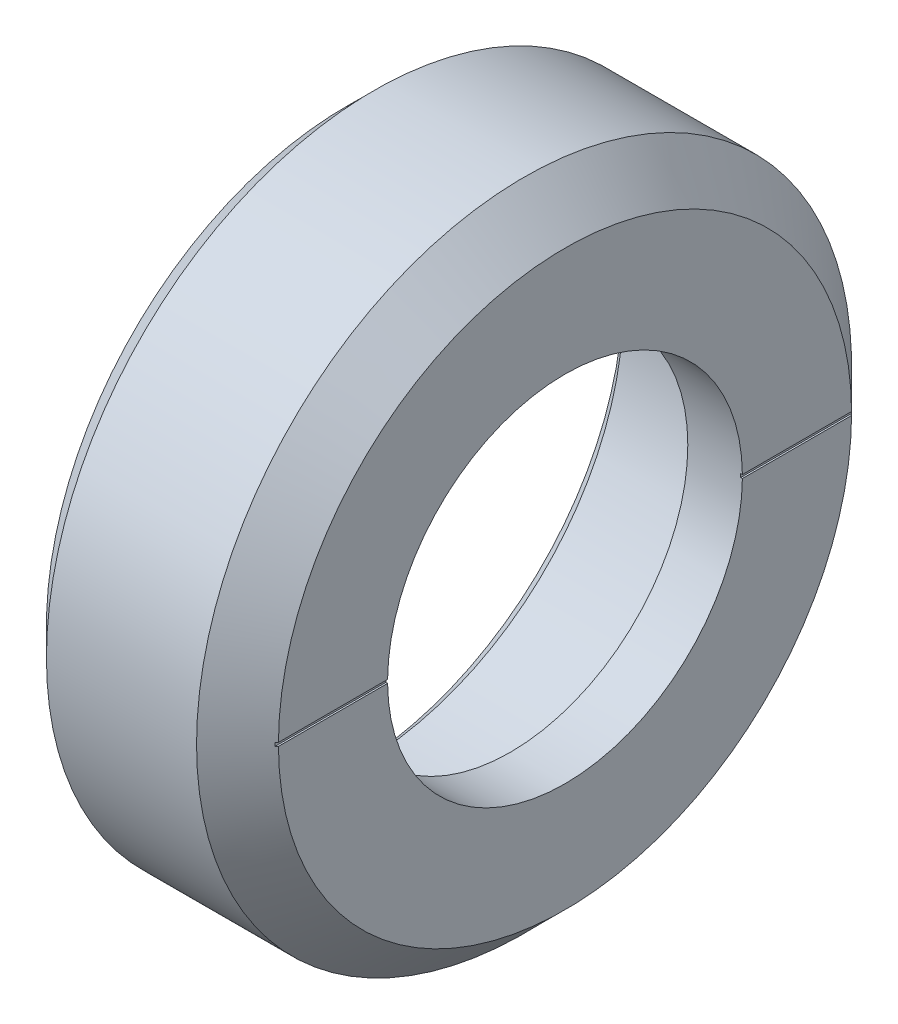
ISO-10303-21;
HEADER;
FILE_DESCRIPTION(('STEP AP214'),'2;1');
FILE_NAME('part.step','',(''),(''),'','','');
FILE_SCHEMA(('AUTOMOTIVE_DESIGN { 1 0 10303 214 1 1 1 1 }'));
ENDSEC;
DATA;
#1=APPLICATION_CONTEXT('core data for automotive mechanical design processes');
#2=APPLICATION_PROTOCOL_DEFINITION('international standard','automotive_design',2000,#1);
#3=PRODUCT_CONTEXT('',#1,'mechanical');
#4=PRODUCT('Part','Part','',(#3));
#5=PRODUCT_RELATED_PRODUCT_CATEGORY('part','',(#4));
#6=PRODUCT_DEFINITION_FORMATION('','',#4);
#7=PRODUCT_DEFINITION_CONTEXT('part definition',#1,'design');
#8=PRODUCT_DEFINITION('design','',#6,#7);
#9=PRODUCT_DEFINITION_SHAPE('','',#8);
#10=(LENGTH_UNIT() NAMED_UNIT(*) SI_UNIT(.MILLI.,.METRE.));
#11=(NAMED_UNIT(*) PLANE_ANGLE_UNIT() SI_UNIT($,.RADIAN.));
#12=(NAMED_UNIT(*) SI_UNIT($,.STERADIAN.) SOLID_ANGLE_UNIT());
#13=UNCERTAINTY_MEASURE_WITH_UNIT(LENGTH_MEASURE(1.E-05),#10,'distance_accuracy_value','');
#14=(GEOMETRIC_REPRESENTATION_CONTEXT(3) GLOBAL_UNCERTAINTY_ASSIGNED_CONTEXT((#13)) GLOBAL_UNIT_ASSIGNED_CONTEXT((#10,
#11,#12)) REPRESENTATION_CONTEXT('',''));
#15=CARTESIAN_POINT('',(0.,0.,0.));
#16=DIRECTION('',(0.,0.,1.));
#17=DIRECTION('',(1.,0.,0.));
#18=AXIS2_PLACEMENT_3D('',#15,#16,#17);
#19=CARTESIAN_POINT('',(16.,24.,0.));
#20=DIRECTION('',(-1.,0.,0.));
#21=DIRECTION('',(0.,0.,1.));
#22=AXIS2_PLACEMENT_3D('',#19,#20,#21);
#23=PLANE('',#22);
#24=DIRECTION('',(0.,0.,1.));
#25=VECTOR('',#24,1.);
#26=CARTESIAN_POINT('',(16.,0.125,0.));
#27=LINE('',#26,#25);
#28=CARTESIAN_POINT('',(16.,0.125,-20.9996279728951));
#29=VERTEX_POINT('',#28);
#30=CARTESIAN_POINT('',(16.,0.125,-12.9993990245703));
#31=VERTEX_POINT('',#30);
#32=EDGE_CURVE('E130',#29,#31,#27,.T.);
#33=ORIENTED_EDGE('',*,*,#32,.F.);
#34=CARTESIAN_POINT('',(16.,0.,0.));
#35=DIRECTION('',(-1.,0.,0.));
#36=DIRECTION('',(0.,0.,1.));
#37=AXIS2_PLACEMENT_3D('',#34,#35,#36);
#38=CIRCLE('',#37,21.);
#39=CARTESIAN_POINT('',(16.,0.125,20.9996279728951));
#40=VERTEX_POINT('',#39);
#41=EDGE_CURVE('E160',#29,#40,#38,.F.);
#42=ORIENTED_EDGE('',*,*,#41,.T.);
#43=CARTESIAN_POINT('',(16.,0.125,12.9993990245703));
#44=VERTEX_POINT('',#43);
#45=EDGE_CURVE('E135',#44,#40,#27,.T.);
#46=ORIENTED_EDGE('',*,*,#45,.F.);
#47=CARTESIAN_POINT('',(16.,0.,0.));
#48=DIRECTION('',(-1.,0.,0.));
#49=DIRECTION('',(0.,0.,1.));
#50=AXIS2_PLACEMENT_3D('',#47,#48,#49);
#51=CIRCLE('',#50,13.);
#52=EDGE_CURVE('E154',#44,#31,#51,.T.);
#53=ORIENTED_EDGE('',*,*,#52,.T.);
#54=EDGE_LOOP('',(#33,#42,#46,#53));
#55=FACE_BOUND('',#54,.T.);
#56=ADVANCED_FACE('F36',(#55),#23,.F.);
#57=DIRECTION('',(0.,0.,-1.));
#58=VECTOR('',#57,1.);
#59=CARTESIAN_POINT('',(16.,-0.125,0.));
#60=LINE('',#59,#58);
#61=CARTESIAN_POINT('',(16.,-0.125,20.9996279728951));
#62=VERTEX_POINT('',#61);
#63=CARTESIAN_POINT('',(16.,-0.125,12.9993990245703));
#64=VERTEX_POINT('',#63);
#65=EDGE_CURVE('E108',#62,#64,#60,.T.);
#66=ORIENTED_EDGE('',*,*,#65,.F.);
#67=CARTESIAN_POINT('',(16.,-0.125,-20.9996279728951));
#68=VERTEX_POINT('',#67);
#69=EDGE_CURVE('E161',#62,#68,#38,.F.);
#70=ORIENTED_EDGE('',*,*,#69,.T.);
#71=CARTESIAN_POINT('',(16.,-0.125,-12.9993990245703));
#72=VERTEX_POINT('',#71);
#73=EDGE_CURVE('E65',#72,#68,#60,.T.);
#74=ORIENTED_EDGE('',*,*,#73,.F.);
#75=EDGE_CURVE('E153',#72,#64,#51,.T.);
#76=ORIENTED_EDGE('',*,*,#75,.T.);
#77=EDGE_LOOP('',(#66,#70,#74,#76));
#78=FACE_BOUND('',#77,.T.);
#79=ADVANCED_FACE('F213',(#78),#23,.F.);
#80=CARTESIAN_POINT('',(0.,0.,0.));
#81=DIRECTION('',(-1.,0.,0.));
#82=DIRECTION('',(0.,0.,1.));
#83=AXIS2_PLACEMENT_3D('',#80,#81,#82);
#84=CYLINDRICAL_SURFACE('',#83,13.);
#85=CARTESIAN_POINT('',(12.,0.,0.));
#86=DIRECTION('',(-1.,0.,0.));
#87=DIRECTION('',(0.,0.,1.));
#88=AXIS2_PLACEMENT_3D('',#85,#86,#87);
#89=CIRCLE('',#88,13.);
#90=CARTESIAN_POINT('',(12.,0.,13.));
#91=VERTEX_POINT('',#90);
#92=EDGE_CURVE('E150',#91,#91,#89,.T.);
#93=ORIENTED_EDGE('',*,*,#92,.T.);
#94=EDGE_LOOP('',(#93));
#95=FACE_BOUND('',#94,.T.);
#96=DIRECTION('',(-1.,0.,0.));
#97=VECTOR('',#96,1.);
#98=CARTESIAN_POINT('',(0.,0.125,-12.9993990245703));
#99=LINE('',#98,#97);
#100=CARTESIAN_POINT('',(15.875,0.125,-12.9993990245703));
#101=VERTEX_POINT('',#100);
#102=EDGE_CURVE('E133',#31,#101,#99,.T.);
#103=ORIENTED_EDGE('',*,*,#102,.F.);
#104=ORIENTED_EDGE('',*,*,#52,.F.);
#105=DIRECTION('',(-1.,0.,0.));
#106=VECTOR('',#105,1.);
#107=CARTESIAN_POINT('',(0.,0.125,12.9993990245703));
#108=LINE('',#107,#106);
#109=CARTESIAN_POINT('',(15.875,0.125,12.9993990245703));
#110=VERTEX_POINT('',#109);
#111=EDGE_CURVE('E129',#110,#44,#108,.F.);
#112=ORIENTED_EDGE('',*,*,#111,.F.);
#113=CARTESIAN_POINT('',(15.875,0.,0.));
#114=DIRECTION('',(1.,0.,0.));
#115=DIRECTION('',(0.,0.,-1.));
#116=AXIS2_PLACEMENT_3D('',#113,#114,#115);
#117=CIRCLE('',#116,13.);
#118=CARTESIAN_POINT('',(15.875,-0.125,12.9993990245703));
#119=VERTEX_POINT('',#118);
#120=EDGE_CURVE('E117',#119,#110,#117,.F.);
#121=ORIENTED_EDGE('',*,*,#120,.F.);
#122=DIRECTION('',(-1.,0.,0.));
#123=VECTOR('',#122,1.);
#124=CARTESIAN_POINT('',(0.,-0.124999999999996,12.9993990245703));
#125=LINE('',#124,#123);
#126=EDGE_CURVE('E105',#64,#119,#125,.T.);
#127=ORIENTED_EDGE('',*,*,#126,.F.);
#128=ORIENTED_EDGE('',*,*,#75,.F.);
#129=DIRECTION('',(-1.,0.,0.));
#130=VECTOR('',#129,1.);
#131=CARTESIAN_POINT('',(0.,-0.124999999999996,-12.9993990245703));
#132=LINE('',#131,#130);
#133=CARTESIAN_POINT('',(15.875,-0.125,-12.9993990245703));
#134=VERTEX_POINT('',#133);
#135=EDGE_CURVE('E136',#134,#72,#132,.F.);
#136=ORIENTED_EDGE('',*,*,#135,.F.);
#137=EDGE_CURVE('E131',#101,#134,#117,.F.);
#138=ORIENTED_EDGE('',*,*,#137,.F.);
#139=EDGE_LOOP('',(#103,#104,#112,#121,#127,#128,#136,#138));
#140=FACE_BOUND('',#139,.T.);
#141=ADVANCED_FACE('F127',(#95,#140),#84,.F.);
#142=CARTESIAN_POINT('',(13.,0.,0.));
#143=DIRECTION('',(-1.,0.,0.));
#144=DIRECTION('',(0.,0.,1.));
#145=AXIS2_PLACEMENT_3D('',#142,#143,#144);
#146=CONICAL_SURFACE('',#145,24.,0.78539816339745);
#147=CARTESIAN_POINT('',(13.,0.,0.));
#148=DIRECTION('',(-1.,0.,0.));
#149=DIRECTION('',(0.,0.,1.));
#150=AXIS2_PLACEMENT_3D('',#147,#148,#149);
#151=CIRCLE('',#150,24.);
#152=CARTESIAN_POINT('',(13.,0.,24.));
#153=VERTEX_POINT('',#152);
#154=EDGE_CURVE('E157',#153,#153,#151,.T.);
#155=ORIENTED_EDGE('',*,*,#154,.F.);
#156=EDGE_LOOP('',(#155));
#157=FACE_BOUND('',#156,.T.);
#158=ORIENTED_EDGE('',*,*,#41,.F.);
#159=CARTESIAN_POINT('',(-12.9252976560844,0.125,49.9251411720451));
#160=CARTESIAN_POINT('',(-9.47868892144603,0.125,46.4785159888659));
#161=CARTESIAN_POINT('',(-6.0320768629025,0.125,43.0318941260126));
#162=CARTESIAN_POINT('',(0.86114243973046,0.125,36.138645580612));
#163=CARTESIAN_POINT('',(4.30774968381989,0.125,32.6920188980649));
#164=CARTESIAN_POINT('',(11.2009590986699,0.125,25.7987380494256));
#165=CARTESIAN_POINT('',(14.6475612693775,0.125,22.3520838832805));
#166=CARTESIAN_POINT('',(21.5407592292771,0.125,15.458769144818));
#167=CARTESIAN_POINT('',(24.9873550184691,0.125,12.0121085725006));
#168=CARTESIAN_POINT('',(29.378847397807,0.125,7.62013753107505));
#169=CARTESIAN_POINT('',(30.323887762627,0.125,6.67497078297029));
#170=CARTESIAN_POINT('',(31.9010751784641,0.125,5.09741305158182));
#171=CARTESIAN_POINT('',(32.5332486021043,0.125,4.46504845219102));
#172=CARTESIAN_POINT('',(33.5882224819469,0.125,3.40951556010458));
#173=CARTESIAN_POINT('',(34.0110626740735,0.125,2.98638695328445));
#174=CARTESIAN_POINT('',(34.7166075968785,0.125,2.28001451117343));
#175=CARTESIAN_POINT('',(34.9993696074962,0.125,1.99682797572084));
#176=CARTESIAN_POINT('',(35.4710250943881,0.125,1.52391912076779));
#177=CARTESIAN_POINT('',(35.6600089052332,0.125,1.3342868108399));
#178=CARTESIAN_POINT('',(35.9750435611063,0.125,1.0174128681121));
#179=CARTESIAN_POINT('',(36.1012198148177,0.125,0.890296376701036));
#180=CARTESIAN_POINT('',(36.2691038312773,0.125,0.720156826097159));
#181=CARTESIAN_POINT('',(36.3111466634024,0.125,0.677464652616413));
#182=CARTESIAN_POINT('',(36.3950680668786,0.125,0.591936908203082));
#183=CARTESIAN_POINT('',(36.4369466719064,0.125,0.549101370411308));
#184=CARTESIAN_POINT('',(36.5065958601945,0.125,0.477356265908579));
#185=CARTESIAN_POINT('',(36.5344501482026,0.125,0.448527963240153));
#186=CARTESIAN_POINT('',(36.5899259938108,0.125,0.390648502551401));
#187=CARTESIAN_POINT('',(36.6175475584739,0.125,0.361597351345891));
#188=CARTESIAN_POINT('',(36.6632939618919,0.125,0.31271820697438));
#189=CARTESIAN_POINT('',(36.6815457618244,0.125,0.293009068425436));
#190=CARTESIAN_POINT('',(36.7176568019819,0.125,0.253303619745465));
#191=CARTESIAN_POINT('',(36.735516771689,0.125,0.233307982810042));
#192=CARTESIAN_POINT('',(36.764563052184,0.125,0.199627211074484));
#193=CARTESIAN_POINT('',(36.7759490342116,0.125,0.18611433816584));
#194=CARTESIAN_POINT('',(36.7982590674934,0.125,0.158557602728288));
#195=CARTESIAN_POINT('',(36.8091797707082,0.125,0.144510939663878));
#196=CARTESIAN_POINT('',(36.8301456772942,0.125,0.115462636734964));
#197=CARTESIAN_POINT('',(36.8401752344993,0.125,0.100449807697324));
#198=CARTESIAN_POINT('',(36.8577745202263,0.125,0.0690623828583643));
#199=CARTESIAN_POINT('',(36.8653729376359,0.125,0.0527067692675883));
#200=CARTESIAN_POINT('',(36.8722910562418,0.125,0.0272919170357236));
#201=CARTESIAN_POINT('',(36.8738624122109,0.125,0.0188987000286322));
#202=CARTESIAN_POINT('',(36.8752665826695,0.125,0.00198824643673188));
#203=CARTESIAN_POINT('',(36.8751057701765,0.125,-0.00652842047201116));
#204=CARTESIAN_POINT('',(36.8731215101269,0.125,-0.0232960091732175));
#205=CARTESIAN_POINT('',(36.8713083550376,0.125,-0.0315482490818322));
#206=CARTESIAN_POINT('',(36.8664308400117,0.125,-0.0477028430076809));
#207=CARTESIAN_POINT('',(36.8633593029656,0.125,-0.0556028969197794));
#208=CARTESIAN_POINT('',(36.8533313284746,0.125,-0.0778265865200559));
#209=CARTESIAN_POINT('',(36.8453389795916,0.125,-0.0916645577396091));
#210=CARTESIAN_POINT('',(36.828048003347,0.125,-0.118516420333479));
#211=CARTESIAN_POINT('',(36.8187435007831,0.125,-0.131526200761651));
#212=CARTESIAN_POINT('',(36.7993638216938,0.125,-0.1571639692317));
#213=CARTESIAN_POINT('',(36.7892818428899,0.125,-0.169786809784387));
#214=CARTESIAN_POINT('',(36.7687529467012,0.125,-0.19467615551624));
#215=CARTESIAN_POINT('',(36.758306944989,0.125,-0.206943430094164));
#216=CARTESIAN_POINT('',(36.7270864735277,0.125,-0.242896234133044));
#217=CARTESIAN_POINT('',(36.7059799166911,0.125,-0.266292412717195));
#218=CARTESIAN_POINT('',(36.6633538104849,0.125,-0.312706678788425));
#219=CARTESIAN_POINT('',(36.6418341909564,0.125,-0.335724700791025));
#220=CARTESIAN_POINT('',(36.5768904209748,0.125,-0.404515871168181));
#221=CARTESIAN_POINT('',(36.5331306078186,0.125,-0.449971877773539));
#222=CARTESIAN_POINT('',(36.4456524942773,0.125,-0.540171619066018));
#223=CARTESIAN_POINT('',(36.4019370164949,0.125,-0.584918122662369));
#224=CARTESIAN_POINT('',(36.3143500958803,0.125,-0.674216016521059));
#225=CARTESIAN_POINT('',(36.2704787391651,0.125,-0.7187674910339));
#226=CARTESIAN_POINT('',(36.1386080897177,0.125,-0.852397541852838));
#227=CARTESIAN_POINT('',(36.0504662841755,0.125,-0.941335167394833));
#228=CARTESIAN_POINT('',(35.8740287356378,0.125,-1.11905822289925));
#229=CARTESIAN_POINT('',(35.7857329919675,0.125,-1.20784365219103));
#230=CARTESIAN_POINT('',(35.5206955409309,0.125,-1.47411687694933));
#231=CARTESIAN_POINT('',(35.3438368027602,0.125,-1.65148814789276));
#232=CARTESIAN_POINT('',(34.989440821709,0.125,-2.00670168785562));
#233=CARTESIAN_POINT('',(34.8119032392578,0.125,-2.18454361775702));
#234=CARTESIAN_POINT('',(34.4567827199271,0.125,-2.54016087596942));
#235=CARTESIAN_POINT('',(34.2791997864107,0.125,-2.71793620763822));
#236=CARTESIAN_POINT('',(33.391905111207,0.125,-3.6060667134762));
#237=CARTESIAN_POINT('',(32.6820054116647,0.125,-4.31623406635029));
#238=CARTESIAN_POINT('',(31.2621288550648,0.125,-5.73652354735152));
#239=CARTESIAN_POINT('',(30.5521519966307,0.125,-6.44664567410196));
#240=CARTESIAN_POINT('',(29.1331392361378,0.125,-7.86587985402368));
#241=CARTESIAN_POINT('',(28.4241033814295,0.125,-8.57499195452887));
#242=CARTESIAN_POINT('',(27.0060235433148,0.125,-9.99319821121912));
#243=CARTESIAN_POINT('',(26.2969795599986,0.125,-10.7022923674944));
#244=CARTESIAN_POINT('',(22.7504204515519,0.125,-14.2490689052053));
#245=CARTESIAN_POINT('',(19.9128549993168,0.125,-17.0867009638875));
#246=CARTESIAN_POINT('',(14.2377022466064,0.125,-22.761957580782));
#247=CARTESIAN_POINT('',(11.4001149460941,0.125,-25.5995821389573));
#248=CARTESIAN_POINT('',(5.72368698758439,0.125,-31.2760664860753));
#249=CARTESIAN_POINT('',(2.88484632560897,0.125,-34.1149262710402));
#250=CARTESIAN_POINT('',(-2.79283656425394,0.125,-39.7926411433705));
#251=CARTESIAN_POINT('',(-5.6316787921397,0.125,-42.6314962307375));
#252=CARTESIAN_POINT('',(-9.21302057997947,0.125,-46.2128515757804));
#253=CARTESIAN_POINT('',(-9.95551915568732,0.125,-46.9553528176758));
#254=CARTESIAN_POINT('',(-11.4404443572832,0.125,-48.4402831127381));
#255=CARTESIAN_POINT('',(-12.1828709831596,0.125,-49.1827121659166));
#256=CARTESIAN_POINT('',(-12.9252976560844,0.125,-49.9251411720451));
#257=B_SPLINE_CURVE_WITH_KNOTS('',3,(#159,#160,#161,#162,#163,#164,#165,#166,#167,#168,#169,
#170,#171,#172,#173,#174,#175,#176,#177,#178,#179,#180,#181,#182,#183,#184,#185,#186,#187,#188,
#189,#190,#191,#192,#193,#194,#195,#196,#197,#198,#199,#200,#201,#202,#203,#204,#205,#206,#207,
#208,#209,#210,#211,#212,#213,#214,#215,#216,#217,#218,#219,#220,#221,#222,#223,#224,#225,#226,
#227,#228,#229,#230,#231,#232,#233,#234,#235,#236,#237,#238,#239,#240,#241,#242,#243,#244,#245,
#246,#247,#248,#249,#250,#251,#252,#253,#254,#255,#256),.UNSPECIFIED.,.F.,.F.,(4,2,2,2,2,2,2,2,
2,2,2,2,2,2,2,2,2,2,2,2,2,2,2,2,2,2,2,2,2,2,2,2,2,2,2,2,2,2,2,2,2,2,2,2,2,2,2,2,4),(0.,
14.6227573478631,29.245514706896,43.8683196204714,58.4911245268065,62.5008593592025,
65.1833495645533,66.977920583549,68.1784787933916,68.9816462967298,69.518963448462,
69.6987187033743,69.8784349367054,69.9986943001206,70.1189500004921,70.199535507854,
70.2799554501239,70.3329628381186,70.386302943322,70.4404456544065,70.4939236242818,
70.5193874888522,70.5447576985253,70.5699709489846,70.5953300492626,70.6430748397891,
70.6910406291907,70.7394882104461,70.7878216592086,70.8823365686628,70.9768676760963,
71.1661496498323,71.3538190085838,71.5413971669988,71.9170427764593,72.2926900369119,
73.0441259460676,73.7980000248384,74.5518288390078,77.5642459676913,80.5767308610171,
83.5850769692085,86.5934022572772,98.6323141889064,110.671256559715,122.715478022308,
134.759692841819,137.909853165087,141.059707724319),.UNSPECIFIED.);
#258=CARTESIAN_POINT('',(15.875,0.125,-21.1246301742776));
#259=VERTEX_POINT('',#258);
#260=EDGE_CURVE('E11',#29,#259,#257,.T.);
#261=ORIENTED_EDGE('',*,*,#260,.T.);
#262=CARTESIAN_POINT('',(15.875,0.,0.));
#263=DIRECTION('',(1.,0.,0.));
#264=DIRECTION('',(0.,0.,-1.));
#265=AXIS2_PLACEMENT_3D('',#262,#263,#264);
#266=CIRCLE('',#265,21.125);
#267=CARTESIAN_POINT('',(15.875,-0.125,-21.1246301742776));
#268=VERTEX_POINT('',#267);
#269=EDGE_CURVE('E50',#259,#268,#266,.F.);
#270=ORIENTED_EDGE('',*,*,#269,.T.);
#271=CARTESIAN_POINT('',(-12.9252976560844,-0.124999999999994,-49.9251411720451));
#272=CARTESIAN_POINT('',(-9.47868892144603,-0.124999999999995,-46.4785159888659));
#273=CARTESIAN_POINT('',(-6.0320768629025,-0.124999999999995,-43.0318941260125));
#274=CARTESIAN_POINT('',(0.861142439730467,-0.124999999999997,-36.138645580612));
#275=CARTESIAN_POINT('',(4.3077496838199,-0.124999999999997,-32.6920188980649));
#276=CARTESIAN_POINT('',(11.2009590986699,-0.124999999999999,-25.7987380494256));
#277=CARTESIAN_POINT('',(14.6475612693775,-0.124999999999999,-22.3520838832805));
#278=CARTESIAN_POINT('',(21.5407592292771,-0.125000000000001,-15.458769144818));
#279=CARTESIAN_POINT('',(24.9873550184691,-0.125000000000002,-12.0121085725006));
#280=CARTESIAN_POINT('',(29.378847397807,-0.125000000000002,-7.62013753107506));
#281=CARTESIAN_POINT('',(30.323887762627,-0.125000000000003,-6.67497078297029));
#282=CARTESIAN_POINT('',(31.9010751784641,-0.125000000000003,-5.09741305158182));
#283=CARTESIAN_POINT('',(32.5332486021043,-0.125000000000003,-4.46504845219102));
#284=CARTESIAN_POINT('',(33.5882224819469,-0.125000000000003,-3.40951556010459));
#285=CARTESIAN_POINT('',(34.0110626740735,-0.125000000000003,-2.98638695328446));
#286=CARTESIAN_POINT('',(34.7166075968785,-0.125000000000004,-2.28001451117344));
#287=CARTESIAN_POINT('',(34.9993696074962,-0.125000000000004,-1.99682797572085));
#288=CARTESIAN_POINT('',(35.4710250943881,-0.125000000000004,-1.52391912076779));
#289=CARTESIAN_POINT('',(35.6600089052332,-0.125000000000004,-1.33428681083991));
#290=CARTESIAN_POINT('',(35.9750435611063,-0.125000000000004,-1.0174128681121));
#291=CARTESIAN_POINT('',(36.1012198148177,-0.125000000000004,-0.890296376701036));
#292=CARTESIAN_POINT('',(36.2691038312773,-0.125000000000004,-0.720156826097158));
#293=CARTESIAN_POINT('',(36.3111466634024,-0.125000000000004,-0.677464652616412));
#294=CARTESIAN_POINT('',(36.3950680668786,-0.125000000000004,-0.591936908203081));
#295=CARTESIAN_POINT('',(36.4369466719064,-0.125000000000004,-0.549101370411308));
#296=CARTESIAN_POINT('',(36.5065958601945,-0.125000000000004,-0.477356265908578));
#297=CARTESIAN_POINT('',(36.5344501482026,-0.125000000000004,-0.448527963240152));
#298=CARTESIAN_POINT('',(36.5899259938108,-0.125000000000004,-0.390648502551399));
#299=CARTESIAN_POINT('',(36.6175475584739,-0.125000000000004,-0.361597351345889));
#300=CARTESIAN_POINT('',(36.6632939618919,-0.125000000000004,-0.312718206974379));
#301=CARTESIAN_POINT('',(36.6815457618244,-0.125000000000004,-0.293009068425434));
#302=CARTESIAN_POINT('',(36.7176568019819,-0.125000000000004,-0.253303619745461));
#303=CARTESIAN_POINT('',(36.735516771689,-0.125000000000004,-0.233307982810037));
#304=CARTESIAN_POINT('',(36.764563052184,-0.125000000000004,-0.199627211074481));
#305=CARTESIAN_POINT('',(36.7759490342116,-0.125000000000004,-0.186114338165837));
#306=CARTESIAN_POINT('',(36.7982590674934,-0.125000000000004,-0.158557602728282));
#307=CARTESIAN_POINT('',(36.8091797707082,-0.125000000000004,-0.144510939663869));
#308=CARTESIAN_POINT('',(36.8301456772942,-0.125000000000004,-0.115462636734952));
#309=CARTESIAN_POINT('',(36.8401752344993,-0.125000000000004,-0.100449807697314));
#310=CARTESIAN_POINT('',(36.8577745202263,-0.125000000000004,-0.0690623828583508));
#311=CARTESIAN_POINT('',(36.8653729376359,-0.125000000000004,-0.0527067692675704));
#312=CARTESIAN_POINT('',(36.8722910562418,-0.125000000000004,-0.0272919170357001));
#313=CARTESIAN_POINT('',(36.873862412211,-0.125000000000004,-0.018898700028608));
#314=CARTESIAN_POINT('',(36.8752665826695,-0.125000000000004,-0.00198824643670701));
#315=CARTESIAN_POINT('',(36.8751057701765,-0.125000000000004,0.00652842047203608));
#316=CARTESIAN_POINT('',(36.8731215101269,-0.125000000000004,0.0232960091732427));
#317=CARTESIAN_POINT('',(36.8713083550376,-0.125000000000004,0.0315482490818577));
#318=CARTESIAN_POINT('',(36.8664308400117,-0.125000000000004,0.0477028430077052));
#319=CARTESIAN_POINT('',(36.8633593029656,-0.125000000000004,0.0556028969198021));
#320=CARTESIAN_POINT('',(36.8533313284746,-0.125000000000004,0.0778265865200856));
#321=CARTESIAN_POINT('',(36.8453389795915,-0.125000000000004,0.091664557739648));
#322=CARTESIAN_POINT('',(36.8280480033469,-0.125000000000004,0.118516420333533));
#323=CARTESIAN_POINT('',(36.818743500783,-0.125000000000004,0.131526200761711));
#324=CARTESIAN_POINT('',(36.7993638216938,-0.125000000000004,0.157163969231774));
#325=CARTESIAN_POINT('',(36.7892818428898,-0.125000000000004,0.169786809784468));
#326=CARTESIAN_POINT('',(36.7687529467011,-0.125000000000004,0.194676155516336));
#327=CARTESIAN_POINT('',(36.7583069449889,-0.125000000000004,0.206943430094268));
#328=CARTESIAN_POINT('',(36.7270864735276,-0.125000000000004,0.242896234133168));
#329=CARTESIAN_POINT('',(36.705979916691,-0.125000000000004,0.266292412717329));
#330=CARTESIAN_POINT('',(36.6633538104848,-0.125000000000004,0.31270667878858));
#331=CARTESIAN_POINT('',(36.6418341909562,-0.125000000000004,0.335724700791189));
#332=CARTESIAN_POINT('',(36.5768904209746,-0.125000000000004,0.404515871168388));
#333=CARTESIAN_POINT('',(36.5331306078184,-0.125000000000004,0.449971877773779));
#334=CARTESIAN_POINT('',(36.445652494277,-0.125000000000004,0.540171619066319));
#335=CARTESIAN_POINT('',(36.4019370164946,-0.125000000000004,0.584918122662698));
#336=CARTESIAN_POINT('',(36.3143500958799,-0.125000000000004,0.674216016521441));
#337=CARTESIAN_POINT('',(36.2704787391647,-0.125000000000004,0.718767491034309));
#338=CARTESIAN_POINT('',(36.1386080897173,-0.125000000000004,0.852397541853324));
#339=CARTESIAN_POINT('',(36.050466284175,-0.125000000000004,0.941335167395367));
#340=CARTESIAN_POINT('',(35.8740287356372,-0.125000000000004,1.11905822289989));
#341=CARTESIAN_POINT('',(35.7857329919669,-0.125000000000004,1.20784365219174));
#342=CARTESIAN_POINT('',(35.52069554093,-0.125000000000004,1.47411687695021));
#343=CARTESIAN_POINT('',(35.3438368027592,-0.125000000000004,1.65148814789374));
#344=CARTESIAN_POINT('',(34.9894408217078,-0.125000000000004,2.00670168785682));
#345=CARTESIAN_POINT('',(34.8119032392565,-0.125000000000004,2.18454361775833));
#346=CARTESIAN_POINT('',(34.4567827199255,-0.125000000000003,2.54016087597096));
#347=CARTESIAN_POINT('',(34.2791997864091,-0.125000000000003,2.71793620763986));
#348=CARTESIAN_POINT('',(33.3919051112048,-0.125000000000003,3.6060667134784));
#349=CARTESIAN_POINT('',(32.6820054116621,-0.125000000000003,4.31623406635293));
#350=CARTESIAN_POINT('',(31.2621288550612,-0.125000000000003,5.73652354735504));
#351=CARTESIAN_POINT('',(30.5521519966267,-0.125000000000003,6.44664567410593));
#352=CARTESIAN_POINT('',(29.133139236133,-0.125000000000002,7.86587985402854));
#353=CARTESIAN_POINT('',(28.4241033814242,-0.125000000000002,8.57499195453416));
#354=CARTESIAN_POINT('',(27.0060235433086,-0.125000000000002,9.9931982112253));
#355=CARTESIAN_POINT('',(26.2969795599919,-0.125000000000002,10.702292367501));
#356=CARTESIAN_POINT('',(22.7504204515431,-0.125000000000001,14.2490689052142));
#357=CARTESIAN_POINT('',(19.9128549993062,-0.125,17.0867009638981));
#358=CARTESIAN_POINT('',(14.2377022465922,-0.124999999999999,22.7619575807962));
#359=CARTESIAN_POINT('',(11.4001149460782,-0.124999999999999,25.5995821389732));
#360=CARTESIAN_POINT('',(5.72368698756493,-0.124999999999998,31.2760664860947));
#361=CARTESIAN_POINT('',(2.88484632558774,-0.124999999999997,34.1149262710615));
#362=CARTESIAN_POINT('',(-2.79283656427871,-0.124999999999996,39.7926411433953));
#363=CARTESIAN_POINT('',(-5.63167879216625,-0.124999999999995,42.6314962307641));
#364=CARTESIAN_POINT('',(-9.21302058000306,-0.124999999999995,46.212851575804));
#365=CARTESIAN_POINT('',(-9.95551915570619,-0.124999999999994,46.9553528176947));
#366=CARTESIAN_POINT('',(-11.4404443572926,-0.124999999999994,48.4402831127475));
#367=CARTESIAN_POINT('',(-12.1828709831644,-0.124999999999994,49.1827121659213));
#368=CARTESIAN_POINT('',(-12.9252976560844,-0.124999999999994,49.9251411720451));
#369=B_SPLINE_CURVE_WITH_KNOTS('',3,(#271,#272,#273,#274,#275,#276,#277,#278,#279,#280,#281,
#282,#283,#284,#285,#286,#287,#288,#289,#290,#291,#292,#293,#294,#295,#296,#297,#298,#299,#300,
#301,#302,#303,#304,#305,#306,#307,#308,#309,#310,#311,#312,#313,#314,#315,#316,#317,#318,#319,
#320,#321,#322,#323,#324,#325,#326,#327,#328,#329,#330,#331,#332,#333,#334,#335,#336,#337,#338,
#339,#340,#341,#342,#343,#344,#345,#346,#347,#348,#349,#350,#351,#352,#353,#354,#355,#356,#357,
#358,#359,#360,#361,#362,#363,#364,#365,#366,#367,#368),.UNSPECIFIED.,.F.,.F.,(4,2,2,2,2,2,2,2,
2,2,2,2,2,2,2,2,2,2,2,2,2,2,2,2,2,2,2,2,2,2,2,2,2,2,2,2,2,2,2,2,2,2,2,2,2,2,2,2,4),(0.,
14.6227573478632,29.2455147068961,43.8683196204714,58.4911245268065,62.5008593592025,
65.1833495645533,66.977920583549,68.1784787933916,68.9816462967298,69.518963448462,
69.6987187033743,69.8784349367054,69.9986943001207,70.1189500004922,70.199535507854,
70.2799554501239,70.3329628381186,70.386302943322,70.4404456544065,70.4939236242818,
70.5193874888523,70.5447576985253,70.5699709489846,70.5953300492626,70.6430748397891,
70.6910406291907,70.7394882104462,70.7878216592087,70.882336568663,70.9768676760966,
71.1661496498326,71.3538190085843,71.5413971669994,71.9170427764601,72.292690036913,
73.0441259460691,73.7980000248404,74.5518288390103,77.5642459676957,80.5767308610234,
83.5850769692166,86.5934022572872,98.6323141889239,110.67125655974,122.715478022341,
134.759692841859,137.909853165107,141.059707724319),.UNSPECIFIED.);
#370=EDGE_CURVE('E181',#268,#68,#369,.T.);
#371=ORIENTED_EDGE('',*,*,#370,.T.);
#372=ORIENTED_EDGE('',*,*,#69,.F.);
#373=CARTESIAN_POINT('',(15.875,-0.125,21.1246301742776));
#374=VERTEX_POINT('',#373);
#375=EDGE_CURVE('E176',#62,#374,#369,.T.);
#376=ORIENTED_EDGE('',*,*,#375,.T.);
#377=CARTESIAN_POINT('',(15.875,0.125,21.1246301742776));
#378=VERTEX_POINT('',#377);
#379=EDGE_CURVE('E120',#374,#378,#266,.F.);
#380=ORIENTED_EDGE('',*,*,#379,.T.);
#381=EDGE_CURVE('E40',#378,#40,#257,.T.);
#382=ORIENTED_EDGE('',*,*,#381,.T.);
#383=EDGE_LOOP('',(#158,#261,#270,#371,#372,#376,#380,#382));
#384=FACE_BOUND('',#383,.T.);
#385=ADVANCED_FACE('F182',(#157,#384),#146,.T.);
#386=CARTESIAN_POINT('',(0.,0.,0.));
#387=DIRECTION('',(-1.,0.,0.));
#388=DIRECTION('',(0.,0.,1.));
#389=AXIS2_PLACEMENT_3D('',#386,#387,#388);
#390=CYLINDRICAL_SURFACE('',#389,19.25);
#391=CARTESIAN_POINT('',(1.,0.,0.));
#392=DIRECTION('',(1.,0.,0.));
#393=DIRECTION('',(0.,0.,-1.));
#394=AXIS2_PLACEMENT_3D('',#391,#392,#393);
#395=CIRCLE('',#394,19.25);
#396=CARTESIAN_POINT('',(1.,0.,-19.25));
#397=VERTEX_POINT('',#396);
#398=EDGE_CURVE('E170',#397,#397,#395,.F.);
#399=ORIENTED_EDGE('',*,*,#398,.T.);
#400=EDGE_LOOP('',(#399));
#401=FACE_BOUND('',#400,.T.);
#402=CARTESIAN_POINT('',(11.,0.,0.));
#403=DIRECTION('',(-1.,0.,0.));
#404=DIRECTION('',(0.,0.,1.));
#405=AXIS2_PLACEMENT_3D('',#402,#403,#404);
#406=CIRCLE('',#405,19.25);
#407=CARTESIAN_POINT('',(11.,0.,19.25));
#408=VERTEX_POINT('',#407);
#409=EDGE_CURVE('E141',#408,#408,#406,.T.);
#410=ORIENTED_EDGE('',*,*,#409,.F.);
#411=EDGE_LOOP('',(#410));
#412=FACE_BOUND('',#411,.T.);
#413=ADVANCED_FACE('F38',(#401,#412),#390,.F.);
#414=CARTESIAN_POINT('',(0.,19.25,0.));
#415=DIRECTION('',(1.,0.,0.));
#416=DIRECTION('',(0.,0.,-1.));
#417=AXIS2_PLACEMENT_3D('',#414,#415,#416);
#418=PLANE('',#417);
#419=CARTESIAN_POINT('',(0.,0.,0.));
#420=DIRECTION('',(1.,0.,0.));
#421=DIRECTION('',(0.,0.,-1.));
#422=AXIS2_PLACEMENT_3D('',#419,#420,#421);
#423=CIRCLE('',#422,20.25);
#424=CARTESIAN_POINT('',(0.,0.,-20.25));
#425=VERTEX_POINT('',#424);
#426=EDGE_CURVE('E173',#425,#425,#423,.T.);
#427=ORIENTED_EDGE('',*,*,#426,.T.);
#428=EDGE_LOOP('',(#427));
#429=FACE_BOUND('',#428,.T.);
#430=CARTESIAN_POINT('',(0.,0.,0.));
#431=DIRECTION('',(1.,0.,0.));
#432=DIRECTION('',(0.,0.,-1.));
#433=AXIS2_PLACEMENT_3D('',#430,#431,#432);
#434=CIRCLE('',#433,22.);
#435=CARTESIAN_POINT('',(0.,0.,-22.));
#436=VERTEX_POINT('',#435);
#437=EDGE_CURVE('E164',#436,#436,#434,.F.);
#438=ORIENTED_EDGE('',*,*,#437,.T.);
#439=EDGE_LOOP('',(#438));
#440=FACE_BOUND('',#439,.T.);
#441=ADVANCED_FACE('F227',(#429,#440),#418,.F.);
#442=CARTESIAN_POINT('',(0.,0.,0.));
#443=DIRECTION('',(-1.,0.,0.));
#444=DIRECTION('',(0.,0.,1.));
#445=AXIS2_PLACEMENT_3D('',#442,#443,#444);
#446=CYLINDRICAL_SURFACE('',#445,24.);
#447=CARTESIAN_POINT('',(2.00000000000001,0.,0.));
#448=DIRECTION('',(1.,0.,0.));
#449=DIRECTION('',(0.,0.,-1.));
#450=AXIS2_PLACEMENT_3D('',#447,#448,#449);
#451=CIRCLE('',#450,24.);
#452=CARTESIAN_POINT('',(2.00000000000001,0.,-24.));
#453=VERTEX_POINT('',#452);
#454=EDGE_CURVE('E167',#453,#453,#451,.T.);
#455=ORIENTED_EDGE('',*,*,#454,.T.);
#456=EDGE_LOOP('',(#455));
#457=FACE_BOUND('',#456,.T.);
#458=ORIENTED_EDGE('',*,*,#154,.T.);
#459=EDGE_LOOP('',(#458));
#460=FACE_BOUND('',#459,.T.);
#461=ADVANCED_FACE('F224',(#457,#460),#446,.T.);
#462=CARTESIAN_POINT('',(12.,13.,0.));
#463=DIRECTION('',(1.,0.,0.));
#464=DIRECTION('',(0.,0.,-1.));
#465=AXIS2_PLACEMENT_3D('',#462,#463,#464);
#466=PLANE('',#465);
#467=ORIENTED_EDGE('',*,*,#92,.F.);
#468=EDGE_LOOP('',(#467));
#469=FACE_BOUND('',#468,.T.);
#470=CARTESIAN_POINT('',(12.,0.,0.));
#471=DIRECTION('',(-1.,0.,0.));
#472=DIRECTION('',(0.,0.,1.));
#473=AXIS2_PLACEMENT_3D('',#470,#471,#472);
#474=CIRCLE('',#473,20.25);
#475=CARTESIAN_POINT('',(12.,0.,20.25));
#476=VERTEX_POINT('',#475);
#477=EDGE_CURVE('E147',#476,#476,#474,.T.);
#478=ORIENTED_EDGE('',*,*,#477,.T.);
#479=EDGE_LOOP('',(#478));
#480=FACE_BOUND('',#479,.T.);
#481=ADVANCED_FACE('F226',(#469,#480),#466,.F.);
#482=CARTESIAN_POINT('',(0.,0.,0.));
#483=DIRECTION('',(-1.,0.,0.));
#484=DIRECTION('',(0.,0.,1.));
#485=AXIS2_PLACEMENT_3D('',#482,#483,#484);
#486=CYLINDRICAL_SURFACE('',#485,20.25);
#487=ORIENTED_EDGE('',*,*,#477,.F.);
#488=EDGE_LOOP('',(#487));
#489=FACE_BOUND('',#488,.T.);
#490=CARTESIAN_POINT('',(11.,0.,0.));
#491=DIRECTION('',(-1.,0.,0.));
#492=DIRECTION('',(0.,0.,1.));
#493=AXIS2_PLACEMENT_3D('',#490,#491,#492);
#494=CIRCLE('',#493,20.25);
#495=CARTESIAN_POINT('',(11.,0.,20.25));
#496=VERTEX_POINT('',#495);
#497=EDGE_CURVE('E144',#496,#496,#494,.T.);
#498=ORIENTED_EDGE('',*,*,#497,.T.);
#499=EDGE_LOOP('',(#498));
#500=FACE_BOUND('',#499,.T.);
#501=ADVANCED_FACE('F208',(#489,#500),#486,.F.);
#502=CARTESIAN_POINT('',(11.,20.25,0.));
#503=DIRECTION('',(-1.,0.,0.));
#504=DIRECTION('',(0.,0.,1.));
#505=AXIS2_PLACEMENT_3D('',#502,#503,#504);
#506=PLANE('',#505);
#507=ORIENTED_EDGE('',*,*,#497,.F.);
#508=EDGE_LOOP('',(#507));
#509=FACE_BOUND('',#508,.T.);
#510=ORIENTED_EDGE('',*,*,#409,.T.);
#511=EDGE_LOOP('',(#510));
#512=FACE_BOUND('',#511,.T.);
#513=ADVANCED_FACE('F203',(#509,#512),#506,.F.);
#514=CARTESIAN_POINT('',(0.,0.,0.));
#515=DIRECTION('',(1.,0.,0.));
#516=DIRECTION('',(0.,0.,-1.));
#517=AXIS2_PLACEMENT_3D('',#514,#515,#516);
#518=CONICAL_SURFACE('',#517,22.,0.785398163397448);
#519=ORIENTED_EDGE('',*,*,#454,.F.);
#520=EDGE_LOOP('',(#519));
#521=FACE_BOUND('',#520,.T.);
#522=ORIENTED_EDGE('',*,*,#437,.F.);
#523=EDGE_LOOP('',(#522));
#524=FACE_BOUND('',#523,.T.);
#525=ADVANCED_FACE('F200',(#521,#524),#518,.T.);
#526=CARTESIAN_POINT('',(1.,0.,0.));
#527=DIRECTION('',(-1.,0.,0.));
#528=DIRECTION('',(0.,0.,1.));
#529=AXIS2_PLACEMENT_3D('',#526,#527,#528);
#530=CONICAL_SURFACE('',#529,19.25,0.78539816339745);
#531=ORIENTED_EDGE('',*,*,#426,.F.);
#532=EDGE_LOOP('',(#531));
#533=FACE_BOUND('',#532,.T.);
#534=ORIENTED_EDGE('',*,*,#398,.F.);
#535=EDGE_LOOP('',(#534));
#536=FACE_BOUND('',#535,.T.);
#537=ADVANCED_FACE('F198',(#533,#536),#530,.F.);
#538=CARTESIAN_POINT('',(18.,-0.125,41.5));
#539=DIRECTION('',(0.,1.,0.));
#540=DIRECTION('',(-1.,0.,0.));
#541=AXIS2_PLACEMENT_3D('',#538,#539,#540);
#542=PLANE('',#541);
#543=ORIENTED_EDGE('',*,*,#126,.T.);
#544=DIRECTION('',(0.,0.,-1.));
#545=VECTOR('',#544,1.);
#546=CARTESIAN_POINT('',(15.875,-0.125,41.5));
#547=LINE('',#546,#545);
#548=EDGE_CURVE('E57',#374,#119,#547,.T.);
#549=ORIENTED_EDGE('',*,*,#548,.F.);
#550=ORIENTED_EDGE('',*,*,#375,.F.);
#551=ORIENTED_EDGE('',*,*,#65,.T.);
#552=EDGE_LOOP('',(#543,#549,#550,#551));
#553=FACE_BOUND('',#552,.T.);
#554=ADVANCED_FACE('F106',(#553),#542,.T.);
#555=CARTESIAN_POINT('',(15.875,0.125,41.5));
#556=DIRECTION('',(1.,0.,0.));
#557=DIRECTION('',(0.,0.,-1.));
#558=AXIS2_PLACEMENT_3D('',#555,#556,#557);
#559=PLANE('',#558);
#560=ORIENTED_EDGE('',*,*,#120,.T.);
#561=DIRECTION('',(0.,0.,-1.));
#562=VECTOR('',#561,1.);
#563=CARTESIAN_POINT('',(15.875,0.125,41.5));
#564=LINE('',#563,#562);
#565=EDGE_CURVE('E268',#378,#110,#564,.T.);
#566=ORIENTED_EDGE('',*,*,#565,.F.);
#567=ORIENTED_EDGE('',*,*,#379,.F.);
#568=ORIENTED_EDGE('',*,*,#548,.T.);
#569=EDGE_LOOP('',(#560,#566,#567,#568));
#570=FACE_BOUND('',#569,.T.);
#571=ADVANCED_FACE('F115',(#570),#559,.T.);
#572=CARTESIAN_POINT('',(18.,0.125,41.5));
#573=DIRECTION('',(0.,-1.,0.));
#574=DIRECTION('',(0.,0.,-1.));
#575=AXIS2_PLACEMENT_3D('',#572,#573,#574);
#576=PLANE('',#575);
#577=ORIENTED_EDGE('',*,*,#111,.T.);
#578=ORIENTED_EDGE('',*,*,#45,.T.);
#579=ORIENTED_EDGE('',*,*,#381,.F.);
#580=ORIENTED_EDGE('',*,*,#565,.T.);
#581=EDGE_LOOP('',(#577,#578,#579,#580));
#582=FACE_BOUND('',#581,.T.);
#583=ADVANCED_FACE('F192',(#582),#576,.T.);
#584=ORIENTED_EDGE('',*,*,#102,.T.);
#585=EDGE_CURVE('E122',#101,#259,#564,.T.);
#586=ORIENTED_EDGE('',*,*,#585,.T.);
#587=ORIENTED_EDGE('',*,*,#260,.F.);
#588=ORIENTED_EDGE('',*,*,#32,.T.);
#589=EDGE_LOOP('',(#584,#586,#587,#588));
#590=FACE_BOUND('',#589,.T.);
#591=ADVANCED_FACE('F196',(#590),#576,.T.);
#592=ORIENTED_EDGE('',*,*,#137,.T.);
#593=EDGE_CURVE('E123',#134,#268,#547,.T.);
#594=ORIENTED_EDGE('',*,*,#593,.T.);
#595=ORIENTED_EDGE('',*,*,#269,.F.);
#596=ORIENTED_EDGE('',*,*,#585,.F.);
#597=EDGE_LOOP('',(#592,#594,#595,#596));
#598=FACE_BOUND('',#597,.T.);
#599=ADVANCED_FACE('F190',(#598),#559,.T.);
#600=ORIENTED_EDGE('',*,*,#135,.T.);
#601=ORIENTED_EDGE('',*,*,#73,.T.);
#602=ORIENTED_EDGE('',*,*,#370,.F.);
#603=ORIENTED_EDGE('',*,*,#593,.F.);
#604=EDGE_LOOP('',(#600,#601,#602,#603));
#605=FACE_BOUND('',#604,.T.);
#606=ADVANCED_FACE('F186',(#605),#542,.T.);
#607=CLOSED_SHELL('',(#56,#79,#141,#385,#413,#441,#461,#481,#501,#513,#525,#537,#554,#571,#583,
#591,#599,#606));
#608=MANIFOLD_SOLID_BREP('B2',#607);
#609=ADVANCED_BREP_SHAPE_REPRESENTATION('',(#18,#608),#14);
#610=SHAPE_DEFINITION_REPRESENTATION(#9,#609);
ENDSEC;
END-ISO-10303-21;
